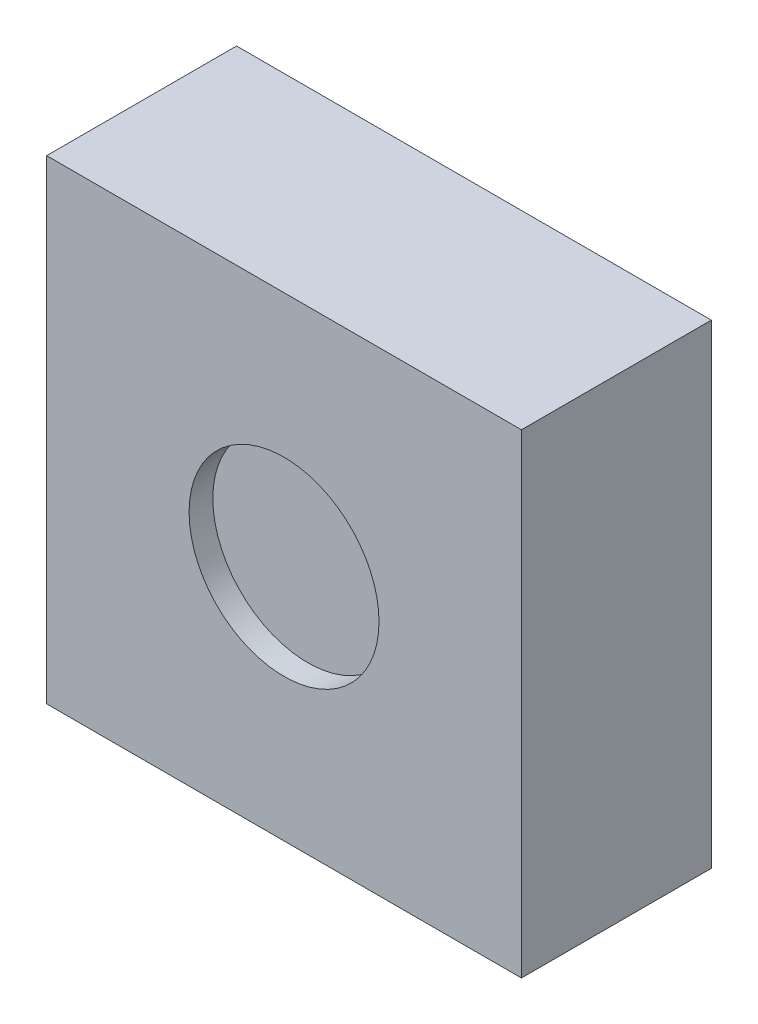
ISO-10303-21;
HEADER;
FILE_DESCRIPTION(('STEP AP214'),'2;1');
FILE_NAME('part.step','',(''),(''),'','','');
FILE_SCHEMA(('AUTOMOTIVE_DESIGN { 1 0 10303 214 1 1 1 1 }'));
ENDSEC;
DATA;
#1=APPLICATION_CONTEXT('core data for automotive mechanical design processes');
#2=APPLICATION_PROTOCOL_DEFINITION('international standard','automotive_design',2000,#1);
#3=PRODUCT_CONTEXT('',#1,'mechanical');
#4=PRODUCT('Part','Part','',(#3));
#5=PRODUCT_RELATED_PRODUCT_CATEGORY('part','',(#4));
#6=PRODUCT_DEFINITION_FORMATION('','',#4);
#7=PRODUCT_DEFINITION_CONTEXT('part definition',#1,'design');
#8=PRODUCT_DEFINITION('design','',#6,#7);
#9=PRODUCT_DEFINITION_SHAPE('','',#8);
#10=(LENGTH_UNIT() NAMED_UNIT(*) SI_UNIT(.MILLI.,.METRE.));
#11=(NAMED_UNIT(*) PLANE_ANGLE_UNIT() SI_UNIT($,.RADIAN.));
#12=(NAMED_UNIT(*) SI_UNIT($,.STERADIAN.) SOLID_ANGLE_UNIT());
#13=UNCERTAINTY_MEASURE_WITH_UNIT(LENGTH_MEASURE(1.E-05),#10,'distance_accuracy_value','');
#14=(GEOMETRIC_REPRESENTATION_CONTEXT(3) GLOBAL_UNCERTAINTY_ASSIGNED_CONTEXT((#13)) GLOBAL_UNIT_ASSIGNED_CONTEXT((#10,
#11,#12)) REPRESENTATION_CONTEXT('',''));
#15=CARTESIAN_POINT('',(0.,0.,0.));
#16=DIRECTION('',(0.,0.,1.));
#17=DIRECTION('',(1.,0.,0.));
#18=AXIS2_PLACEMENT_3D('',#15,#16,#17);
#19=CARTESIAN_POINT('',(63.4999999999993,63.5000000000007,50.8));
#20=DIRECTION('',(-0.999999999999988,0.,0.));
#21=DIRECTION('',(0.,0.,1.00000000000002));
#22=AXIS2_PLACEMENT_3D('',#19,#20,#21);
#23=PLANE('',#22);
#24=DIRECTION('',(0.,1.,0.));
#25=VECTOR('',#24,1.);
#26=CARTESIAN_POINT('',(63.4999999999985,63.5,0.));
#27=LINE('',#26,#25);
#28=CARTESIAN_POINT('',(63.5,-63.5,0.));
#29=VERTEX_POINT('',#28);
#30=CARTESIAN_POINT('',(63.4999999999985,63.5,0.));
#31=VERTEX_POINT('',#30);
#32=EDGE_CURVE('E94',#29,#31,#27,.T.);
#33=ORIENTED_EDGE('',*,*,#32,.T.);
#34=DIRECTION('',(0.,0.,-1.00000000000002));
#35=VECTOR('',#34,1.);
#36=CARTESIAN_POINT('',(63.4999999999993,63.5000000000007,50.8));
#37=LINE('',#36,#35);
#38=CARTESIAN_POINT('',(63.4999999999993,63.5000000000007,50.8));
#39=VERTEX_POINT('',#38);
#40=EDGE_CURVE('E11',#39,#31,#37,.T.);
#41=ORIENTED_EDGE('',*,*,#40,.F.);
#42=DIRECTION('',(0.,1.,0.));
#43=VECTOR('',#42,1.);
#44=CARTESIAN_POINT('',(63.4999999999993,63.5000000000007,50.8));
#45=LINE('',#44,#43);
#46=CARTESIAN_POINT('',(63.5,-63.5,50.8));
#47=VERTEX_POINT('',#46);
#48=EDGE_CURVE('E82',#47,#39,#45,.T.);
#49=ORIENTED_EDGE('',*,*,#48,.F.);
#50=DIRECTION('',(0.,0.,-1.00000000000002));
#51=VECTOR('',#50,1.);
#52=CARTESIAN_POINT('',(63.5,-63.5,50.8));
#53=LINE('',#52,#51);
#54=EDGE_CURVE('E90',#47,#29,#53,.T.);
#55=ORIENTED_EDGE('',*,*,#54,.T.);
#56=EDGE_LOOP('',(#33,#41,#49,#55));
#57=FACE_BOUND('',#56,.T.);
#58=ADVANCED_FACE('F31',(#57),#23,.F.);
#59=CARTESIAN_POINT('',(-63.5,63.5,50.8));
#60=DIRECTION('',(0.,-1.,0.));
#61=DIRECTION('',(0.,0.,-1.00000000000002));
#62=AXIS2_PLACEMENT_3D('',#59,#60,#61);
#63=PLANE('',#62);
#64=DIRECTION('',(-0.999999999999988,0.,0.));
#65=VECTOR('',#64,1.);
#66=CARTESIAN_POINT('',(-63.5,63.5,0.));
#67=LINE('',#66,#65);
#68=CARTESIAN_POINT('',(-63.5,63.5,0.));
#69=VERTEX_POINT('',#68);
#70=EDGE_CURVE('E86',#31,#69,#67,.T.);
#71=ORIENTED_EDGE('',*,*,#70,.T.);
#72=DIRECTION('',(0.,0.,-1.00000000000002));
#73=VECTOR('',#72,1.);
#74=CARTESIAN_POINT('',(-63.5,63.5,50.8));
#75=LINE('',#74,#73);
#76=CARTESIAN_POINT('',(-63.5,63.5,50.8));
#77=VERTEX_POINT('',#76);
#78=EDGE_CURVE('E39',#77,#69,#75,.T.);
#79=ORIENTED_EDGE('',*,*,#78,.F.);
#80=DIRECTION('',(-0.999999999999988,0.,0.));
#81=VECTOR('',#80,1.);
#82=CARTESIAN_POINT('',(-63.5,63.5,50.8));
#83=LINE('',#82,#81);
#84=EDGE_CURVE('E77',#39,#77,#83,.T.);
#85=ORIENTED_EDGE('',*,*,#84,.F.);
#86=ORIENTED_EDGE('',*,*,#40,.T.);
#87=EDGE_LOOP('',(#71,#79,#85,#86));
#88=FACE_BOUND('',#87,.T.);
#89=ADVANCED_FACE('F85',(#88),#63,.F.);
#90=CARTESIAN_POINT('',(-63.5,63.5,50.8));
#91=DIRECTION('',(0.999999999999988,0.,0.));
#92=DIRECTION('',(0.,0.,-1.00000000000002));
#93=AXIS2_PLACEMENT_3D('',#90,#91,#92);
#94=PLANE('',#93);
#95=DIRECTION('',(0.,-1.,0.));
#96=VECTOR('',#95,1.);
#97=CARTESIAN_POINT('',(-63.5,63.5,0.));
#98=LINE('',#97,#96);
#99=CARTESIAN_POINT('',(-63.5,-63.5,0.));
#100=VERTEX_POINT('',#99);
#101=EDGE_CURVE('E64',#69,#100,#98,.T.);
#102=ORIENTED_EDGE('',*,*,#101,.T.);
#103=DIRECTION('',(0.,0.,-1.00000000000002));
#104=VECTOR('',#103,1.);
#105=CARTESIAN_POINT('',(-63.5,-63.5,50.8));
#106=LINE('',#105,#104);
#107=CARTESIAN_POINT('',(-63.5,-63.5,50.8));
#108=VERTEX_POINT('',#107);
#109=EDGE_CURVE('E87',#108,#100,#106,.T.);
#110=ORIENTED_EDGE('',*,*,#109,.F.);
#111=DIRECTION('',(0.,-1.,0.));
#112=VECTOR('',#111,1.);
#113=CARTESIAN_POINT('',(-63.5,63.5,50.8));
#114=LINE('',#113,#112);
#115=EDGE_CURVE('E80',#77,#108,#114,.T.);
#116=ORIENTED_EDGE('',*,*,#115,.F.);
#117=ORIENTED_EDGE('',*,*,#78,.T.);
#118=EDGE_LOOP('',(#102,#110,#116,#117));
#119=FACE_BOUND('',#118,.T.);
#120=ADVANCED_FACE('F88',(#119),#94,.F.);
#121=CARTESIAN_POINT('',(-63.5,-63.5,50.8));
#122=DIRECTION('',(0.,1.,0.));
#123=DIRECTION('',(0.,0.,1.00000000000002));
#124=AXIS2_PLACEMENT_3D('',#121,#122,#123);
#125=PLANE('',#124);
#126=DIRECTION('',(0.999999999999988,0.,0.));
#127=VECTOR('',#126,1.);
#128=CARTESIAN_POINT('',(-63.5,-63.5,0.));
#129=LINE('',#128,#127);
#130=EDGE_CURVE('E70',#100,#29,#129,.T.);
#131=ORIENTED_EDGE('',*,*,#130,.T.);
#132=ORIENTED_EDGE('',*,*,#54,.F.);
#133=DIRECTION('',(0.999999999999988,0.,0.));
#134=VECTOR('',#133,1.);
#135=CARTESIAN_POINT('',(-63.5,-63.5,50.8));
#136=LINE('',#135,#134);
#137=EDGE_CURVE('E47',#108,#47,#136,.T.);
#138=ORIENTED_EDGE('',*,*,#137,.F.);
#139=ORIENTED_EDGE('',*,*,#109,.T.);
#140=EDGE_LOOP('',(#131,#132,#138,#139));
#141=FACE_BOUND('',#140,.T.);
#142=ADVANCED_FACE('F102',(#141),#125,.F.);
#143=CARTESIAN_POINT('',(63.5,-63.5,50.8));
#144=DIRECTION('',(0.,0.,1.00000000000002));
#145=DIRECTION('',(0.999999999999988,0.,0.));
#146=AXIS2_PLACEMENT_3D('',#143,#144,#145);
#147=PLANE('',#146);
#148=CARTESIAN_POINT('',(0.,-7.35522753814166E-13,50.8));
#149=DIRECTION('',(0.,0.,1.00000000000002));
#150=DIRECTION('',(0.999999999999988,0.,0.));
#151=AXIS2_PLACEMENT_3D('',#148,#149,#150);
#152=CIRCLE('',#151,25.4);
#153=CARTESIAN_POINT('',(25.3999999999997,-7.24589437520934E-13,50.8));
#154=VERTEX_POINT('',#153);
#155=EDGE_CURVE('E108',#154,#154,#152,.T.);
#156=ORIENTED_EDGE('',*,*,#155,.F.);
#157=EDGE_LOOP('',(#156));
#158=FACE_BOUND('',#157,.T.);
#159=ORIENTED_EDGE('',*,*,#48,.T.);
#160=ORIENTED_EDGE('',*,*,#84,.T.);
#161=ORIENTED_EDGE('',*,*,#115,.T.);
#162=ORIENTED_EDGE('',*,*,#137,.T.);
#163=EDGE_LOOP('',(#159,#160,#161,#162));
#164=FACE_BOUND('',#163,.T.);
#165=ADVANCED_FACE('F78',(#158,#164),#147,.T.);
#166=CARTESIAN_POINT('',(63.5,-63.5,0.));
#167=DIRECTION('',(0.,0.,1.00000000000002));
#168=DIRECTION('',(0.999999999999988,0.,0.));
#169=AXIS2_PLACEMENT_3D('',#166,#167,#168);
#170=PLANE('',#169);
#171=CARTESIAN_POINT('',(47.6249999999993,-47.625,0.));
#172=DIRECTION('',(0.,0.,-1.00000000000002));
#173=DIRECTION('',(0.999999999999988,0.,0.));
#174=AXIS2_PLACEMENT_3D('',#171,#172,#173);
#175=CIRCLE('',#174,3.175);
#176=CARTESIAN_POINT('',(50.7999999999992,-47.625,0.));
#177=VERTEX_POINT('',#176);
#178=EDGE_CURVE('E132',#177,#177,#175,.T.);
#179=ORIENTED_EDGE('',*,*,#178,.F.);
#180=EDGE_LOOP('',(#179));
#181=FACE_BOUND('',#180,.T.);
#182=CARTESIAN_POINT('',(-47.6249999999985,-47.625,0.));
#183=DIRECTION('',(0.,0.,-1.00000000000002));
#184=DIRECTION('',(-0.999999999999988,0.,0.));
#185=AXIS2_PLACEMENT_3D('',#182,#183,#184);
#186=CIRCLE('',#185,3.175);
#187=CARTESIAN_POINT('',(-50.7999999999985,-47.625,0.));
#188=VERTEX_POINT('',#187);
#189=EDGE_CURVE('E126',#188,#188,#186,.T.);
#190=ORIENTED_EDGE('',*,*,#189,.F.);
#191=EDGE_LOOP('',(#190));
#192=FACE_BOUND('',#191,.T.);
#193=CARTESIAN_POINT('',(-47.625,47.625,0.));
#194=DIRECTION('',(0.,0.,-1.00000000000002));
#195=DIRECTION('',(0.999999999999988,0.,0.));
#196=AXIS2_PLACEMENT_3D('',#193,#194,#195);
#197=CIRCLE('',#196,3.175);
#198=CARTESIAN_POINT('',(-44.45,47.625,0.));
#199=VERTEX_POINT('',#198);
#200=EDGE_CURVE('E120',#199,#199,#197,.T.);
#201=ORIENTED_EDGE('',*,*,#200,.F.);
#202=EDGE_LOOP('',(#201));
#203=FACE_BOUND('',#202,.T.);
#204=CARTESIAN_POINT('',(47.6249999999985,47.625,0.));
#205=DIRECTION('',(0.,0.,-1.00000000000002));
#206=DIRECTION('',(-0.999999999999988,0.,0.));
#207=AXIS2_PLACEMENT_3D('',#204,#205,#206);
#208=CIRCLE('',#207,3.175);
#209=CARTESIAN_POINT('',(44.4499999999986,47.625,0.));
#210=VERTEX_POINT('',#209);
#211=EDGE_CURVE('E114',#210,#210,#208,.T.);
#212=ORIENTED_EDGE('',*,*,#211,.F.);
#213=EDGE_LOOP('',(#212));
#214=FACE_BOUND('',#213,.T.);
#215=ORIENTED_EDGE('',*,*,#32,.F.);
#216=ORIENTED_EDGE('',*,*,#130,.F.);
#217=ORIENTED_EDGE('',*,*,#101,.F.);
#218=ORIENTED_EDGE('',*,*,#70,.F.);
#219=EDGE_LOOP('',(#215,#216,#217,#218));
#220=FACE_BOUND('',#219,.T.);
#221=ADVANCED_FACE('F105',(#181,#192,#203,#214,#220),#170,.F.);
#222=CARTESIAN_POINT('',(0.,-7.35522753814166E-13,44.45));
#223=DIRECTION('',(0.,0.,1.00000000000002));
#224=DIRECTION('',(0.999999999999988,0.,0.));
#225=AXIS2_PLACEMENT_3D('',#222,#223,#224);
#226=CYLINDRICAL_SURFACE('',#225,25.4);
#227=CARTESIAN_POINT('',(0.,-7.35522753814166E-13,44.45));
#228=DIRECTION('',(0.,0.,1.00000000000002));
#229=DIRECTION('',(0.999999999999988,0.,0.));
#230=AXIS2_PLACEMENT_3D('',#227,#228,#229);
#231=CIRCLE('',#230,25.4);
#232=CARTESIAN_POINT('',(25.3999999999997,-7.24589437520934E-13,44.45));
#233=VERTEX_POINT('',#232);
#234=EDGE_CURVE('E97',#233,#233,#231,.T.);
#235=ORIENTED_EDGE('',*,*,#234,.F.);
#236=EDGE_LOOP('',(#235));
#237=FACE_BOUND('',#236,.T.);
#238=ORIENTED_EDGE('',*,*,#155,.T.);
#239=EDGE_LOOP('',(#238));
#240=FACE_BOUND('',#239,.T.);
#241=ADVANCED_FACE('F149',(#237,#240),#226,.F.);
#242=CARTESIAN_POINT('',(0.,-7.35522753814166E-13,44.45));
#243=DIRECTION('',(0.,0.,1.00000000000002));
#244=DIRECTION('',(0.999999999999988,0.,0.));
#245=AXIS2_PLACEMENT_3D('',#242,#243,#244);
#246=PLANE('',#245);
#247=ORIENTED_EDGE('',*,*,#234,.T.);
#248=EDGE_LOOP('',(#247));
#249=FACE_BOUND('',#248,.T.);
#250=ADVANCED_FACE('F160',(#249),#246,.T.);
#251=CARTESIAN_POINT('',(47.6249999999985,47.6249999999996,12.7));
#252=DIRECTION('',(0.,0.,-1.00000000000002));
#253=DIRECTION('',(-0.999999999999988,0.,0.));
#254=AXIS2_PLACEMENT_3D('',#251,#252,#253);
#255=CYLINDRICAL_SURFACE('',#254,3.175);
#256=CARTESIAN_POINT('',(47.6249999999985,47.6249999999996,12.7));
#257=DIRECTION('',(0.,0.,-1.00000000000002));
#258=DIRECTION('',(-0.999999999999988,0.,0.));
#259=AXIS2_PLACEMENT_3D('',#256,#257,#258);
#260=CIRCLE('',#259,3.175);
#261=CARTESIAN_POINT('',(44.4499999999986,47.6249999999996,12.7));
#262=VERTEX_POINT('',#261);
#263=EDGE_CURVE('E111',#262,#262,#260,.T.);
#264=ORIENTED_EDGE('',*,*,#263,.F.);
#265=EDGE_LOOP('',(#264));
#266=FACE_BOUND('',#265,.T.);
#267=ORIENTED_EDGE('',*,*,#211,.T.);
#268=EDGE_LOOP('',(#267));
#269=FACE_BOUND('',#268,.T.);
#270=ADVANCED_FACE('F157',(#266,#269),#255,.F.);
#271=CARTESIAN_POINT('',(47.6249999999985,47.6249999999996,12.7));
#272=DIRECTION('',(0.,0.,-1.00000000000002));
#273=DIRECTION('',(-0.999999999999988,0.,0.));
#274=AXIS2_PLACEMENT_3D('',#271,#272,#273);
#275=PLANE('',#274);
#276=ORIENTED_EDGE('',*,*,#263,.T.);
#277=EDGE_LOOP('',(#276));
#278=FACE_BOUND('',#277,.T.);
#279=ADVANCED_FACE('F159',(#278),#275,.T.);
#280=CARTESIAN_POINT('',(-47.625,47.6249999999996,12.7));
#281=DIRECTION('',(0.,0.,-1.00000000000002));
#282=DIRECTION('',(-0.999999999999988,0.,0.));
#283=AXIS2_PLACEMENT_3D('',#280,#281,#282);
#284=CYLINDRICAL_SURFACE('',#283,3.175);
#285=CARTESIAN_POINT('',(-47.625,47.6249999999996,12.7));
#286=DIRECTION('',(0.,0.,-1.00000000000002));
#287=DIRECTION('',(0.999999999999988,0.,0.));
#288=AXIS2_PLACEMENT_3D('',#285,#286,#287);
#289=CIRCLE('',#288,3.175);
#290=CARTESIAN_POINT('',(-44.45,47.6249999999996,12.7));
#291=VERTEX_POINT('',#290);
#292=EDGE_CURVE('E117',#291,#291,#289,.T.);
#293=ORIENTED_EDGE('',*,*,#292,.F.);
#294=EDGE_LOOP('',(#293));
#295=FACE_BOUND('',#294,.T.);
#296=ORIENTED_EDGE('',*,*,#200,.T.);
#297=EDGE_LOOP('',(#296));
#298=FACE_BOUND('',#297,.T.);
#299=ADVANCED_FACE('F167',(#295,#298),#284,.F.);
#300=CARTESIAN_POINT('',(-47.625,47.6249999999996,12.7));
#301=DIRECTION('',(0.,0.,1.00000000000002));
#302=DIRECTION('',(0.999999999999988,0.,0.));
#303=AXIS2_PLACEMENT_3D('',#300,#301,#302);
#304=PLANE('',#303);
#305=ORIENTED_EDGE('',*,*,#292,.T.);
#306=EDGE_LOOP('',(#305));
#307=FACE_BOUND('',#306,.T.);
#308=ADVANCED_FACE('F213',(#307),#304,.F.);
#309=CARTESIAN_POINT('',(-47.6249999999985,-47.625,12.7));
#310=DIRECTION('',(0.,0.,-1.00000000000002));
#311=DIRECTION('',(-0.999999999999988,0.,0.));
#312=AXIS2_PLACEMENT_3D('',#309,#310,#311);
#313=CYLINDRICAL_SURFACE('',#312,3.175);
#314=CARTESIAN_POINT('',(-47.6249999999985,-47.625,12.7));
#315=DIRECTION('',(0.,0.,-1.00000000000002));
#316=DIRECTION('',(-0.999999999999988,0.,0.));
#317=AXIS2_PLACEMENT_3D('',#314,#315,#316);
#318=CIRCLE('',#317,3.175);
#319=CARTESIAN_POINT('',(-50.7999999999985,-47.625,12.7));
#320=VERTEX_POINT('',#319);
#321=EDGE_CURVE('E123',#320,#320,#318,.T.);
#322=ORIENTED_EDGE('',*,*,#321,.F.);
#323=EDGE_LOOP('',(#322));
#324=FACE_BOUND('',#323,.T.);
#325=ORIENTED_EDGE('',*,*,#189,.T.);
#326=EDGE_LOOP('',(#325));
#327=FACE_BOUND('',#326,.T.);
#328=ADVANCED_FACE('F221',(#324,#327),#313,.F.);
#329=CARTESIAN_POINT('',(-47.6249999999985,-47.625,12.7));
#330=DIRECTION('',(0.,0.,-1.00000000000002));
#331=DIRECTION('',(-0.999999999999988,0.,0.));
#332=AXIS2_PLACEMENT_3D('',#329,#330,#331);
#333=PLANE('',#332);
#334=ORIENTED_EDGE('',*,*,#321,.T.);
#335=EDGE_LOOP('',(#334));
#336=FACE_BOUND('',#335,.T.);
#337=ADVANCED_FACE('F143',(#336),#333,.T.);
#338=CARTESIAN_POINT('',(47.6249999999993,-47.625,12.7));
#339=DIRECTION('',(0.,0.,-1.00000000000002));
#340=DIRECTION('',(-0.999999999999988,0.,0.));
#341=AXIS2_PLACEMENT_3D('',#338,#339,#340);
#342=CYLINDRICAL_SURFACE('',#341,3.175);
#343=CARTESIAN_POINT('',(47.6249999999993,-47.625,12.7));
#344=DIRECTION('',(0.,0.,-1.00000000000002));
#345=DIRECTION('',(0.999999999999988,0.,0.));
#346=AXIS2_PLACEMENT_3D('',#343,#344,#345);
#347=CIRCLE('',#346,3.175);
#348=CARTESIAN_POINT('',(50.7999999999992,-47.625,12.7));
#349=VERTEX_POINT('',#348);
#350=EDGE_CURVE('E129',#349,#349,#347,.T.);
#351=ORIENTED_EDGE('',*,*,#350,.F.);
#352=EDGE_LOOP('',(#351));
#353=FACE_BOUND('',#352,.T.);
#354=ORIENTED_EDGE('',*,*,#178,.T.);
#355=EDGE_LOOP('',(#354));
#356=FACE_BOUND('',#355,.T.);
#357=ADVANCED_FACE('F140',(#353,#356),#342,.F.);
#358=CARTESIAN_POINT('',(47.6249999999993,-47.625,12.7));
#359=DIRECTION('',(0.,0.,1.00000000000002));
#360=DIRECTION('',(0.999999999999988,0.,0.));
#361=AXIS2_PLACEMENT_3D('',#358,#359,#360);
#362=PLANE('',#361);
#363=ORIENTED_EDGE('',*,*,#350,.T.);
#364=EDGE_LOOP('',(#363));
#365=FACE_BOUND('',#364,.T.);
#366=ADVANCED_FACE('F138',(#365),#362,.F.);
#367=CLOSED_SHELL('',(#58,#89,#120,#142,#165,#221,#241,#250,#270,#279,#299,#308,#328,#337,#357,#366));
#368=MANIFOLD_SOLID_BREP('B2',#367);
#369=ADVANCED_BREP_SHAPE_REPRESENTATION('',(#18,#368),#14);
#370=SHAPE_DEFINITION_REPRESENTATION(#9,#369);
ENDSEC;
END-ISO-10303-21;
